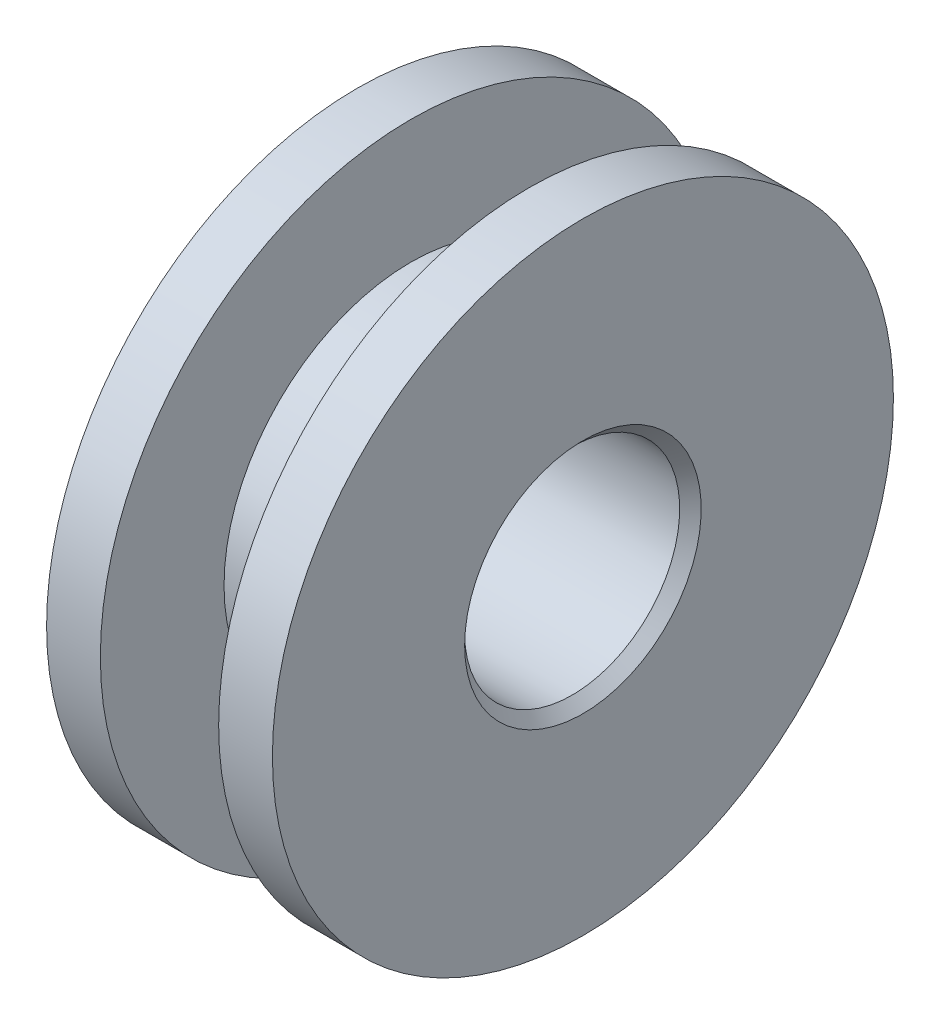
ISO-10303-21;
HEADER;
FILE_DESCRIPTION(('STEP AP214'),'2;1');
FILE_NAME('part.step','',(''),(''),'','','');
FILE_SCHEMA(('AUTOMOTIVE_DESIGN { 1 0 10303 214 1 1 1 1 }'));
ENDSEC;
DATA;
#1=APPLICATION_CONTEXT('core data for automotive mechanical design processes');
#2=APPLICATION_PROTOCOL_DEFINITION('international standard','automotive_design',2000,#1);
#3=PRODUCT_CONTEXT('',#1,'mechanical');
#4=PRODUCT('Part','Part','',(#3));
#5=PRODUCT_RELATED_PRODUCT_CATEGORY('part','',(#4));
#6=PRODUCT_DEFINITION_FORMATION('','',#4);
#7=PRODUCT_DEFINITION_CONTEXT('part definition',#1,'design');
#8=PRODUCT_DEFINITION('design','',#6,#7);
#9=PRODUCT_DEFINITION_SHAPE('','',#8);
#10=(LENGTH_UNIT() NAMED_UNIT(*) SI_UNIT(.MILLI.,.METRE.));
#11=(NAMED_UNIT(*) PLANE_ANGLE_UNIT() SI_UNIT($,.RADIAN.));
#12=(NAMED_UNIT(*) SI_UNIT($,.STERADIAN.) SOLID_ANGLE_UNIT());
#13=UNCERTAINTY_MEASURE_WITH_UNIT(LENGTH_MEASURE(1.E-05),#10,'distance_accuracy_value','');
#14=(GEOMETRIC_REPRESENTATION_CONTEXT(3) GLOBAL_UNCERTAINTY_ASSIGNED_CONTEXT((#13)) GLOBAL_UNIT_ASSIGNED_CONTEXT((#10,
#11,#12)) REPRESENTATION_CONTEXT('',''));
#15=CARTESIAN_POINT('',(0.,0.,0.));
#16=DIRECTION('',(0.,0.,1.));
#17=DIRECTION('',(1.,0.,0.));
#18=AXIS2_PLACEMENT_3D('',#15,#16,#17);
#19=CARTESIAN_POINT('',(0.,0.,0.));
#20=DIRECTION('',(-1.,0.,0.));
#21=DIRECTION('',(0.,0.,1.));
#22=AXIS2_PLACEMENT_3D('',#19,#20,#21);
#23=CYLINDRICAL_SURFACE('',#22,14.4360098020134);
#24=CARTESIAN_POINT('',(0.,0.,0.));
#25=DIRECTION('',(-1.,0.,0.));
#26=DIRECTION('',(0.,0.,1.));
#27=AXIS2_PLACEMENT_3D('',#24,#25,#26);
#28=CIRCLE('',#27,14.4360098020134);
#29=CARTESIAN_POINT('',(0.,0.,14.4360098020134));
#30=VERTEX_POINT('',#29);
#31=EDGE_CURVE('E49',#30,#30,#28,.T.);
#32=ORIENTED_EDGE('',*,*,#31,.F.);
#33=EDGE_LOOP('',(#32));
#34=FACE_BOUND('',#33,.T.);
#35=CARTESIAN_POINT('',(2.5,0.,0.));
#36=DIRECTION('',(-1.,0.,0.));
#37=DIRECTION('',(0.,0.,1.));
#38=AXIS2_PLACEMENT_3D('',#35,#36,#37);
#39=CIRCLE('',#38,14.4360098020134);
#40=CARTESIAN_POINT('',(2.5,0.,14.4360098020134));
#41=VERTEX_POINT('',#40);
#42=EDGE_CURVE('E64',#41,#41,#39,.T.);
#43=ORIENTED_EDGE('',*,*,#42,.T.);
#44=EDGE_LOOP('',(#43));
#45=FACE_BOUND('',#44,.T.);
#46=ADVANCED_FACE('F29',(#34,#45),#23,.T.);
#47=CARTESIAN_POINT('',(0.,5.,0.));
#48=DIRECTION('',(1.,0.,0.));
#49=DIRECTION('',(0.,0.,-1.));
#50=AXIS2_PLACEMENT_3D('',#47,#48,#49);
#51=PLANE('',#50);
#52=CARTESIAN_POINT('',(0.,0.,0.));
#53=DIRECTION('',(1.,0.,0.));
#54=DIRECTION('',(0.,0.,-1.));
#55=AXIS2_PLACEMENT_3D('',#52,#53,#54);
#56=CIRCLE('',#55,5.5);
#57=CARTESIAN_POINT('',(0.,0.,-5.5));
#58=VERTEX_POINT('',#57);
#59=EDGE_CURVE('E36',#58,#58,#56,.T.);
#60=ORIENTED_EDGE('',*,*,#59,.T.);
#61=EDGE_LOOP('',(#60));
#62=FACE_BOUND('',#61,.T.);
#63=ORIENTED_EDGE('',*,*,#31,.T.);
#64=EDGE_LOOP('',(#63));
#65=FACE_BOUND('',#64,.T.);
#66=ADVANCED_FACE('F101',(#62,#65),#51,.F.);
#67=CARTESIAN_POINT('',(0.,0.,0.));
#68=DIRECTION('',(-1.,0.,0.));
#69=DIRECTION('',(0.,0.,1.));
#70=AXIS2_PLACEMENT_3D('',#67,#68,#69);
#71=CYLINDRICAL_SURFACE('',#70,5.);
#72=CARTESIAN_POINT('',(0.5,0.,0.));
#73=DIRECTION('',(1.,0.,0.));
#74=DIRECTION('',(0.,0.,-1.));
#75=AXIS2_PLACEMENT_3D('',#72,#73,#74);
#76=CIRCLE('',#75,5.);
#77=CARTESIAN_POINT('',(0.5,0.,-5.));
#78=VERTEX_POINT('',#77);
#79=EDGE_CURVE('E40',#78,#78,#76,.F.);
#80=ORIENTED_EDGE('',*,*,#79,.T.);
#81=EDGE_LOOP('',(#80));
#82=FACE_BOUND('',#81,.T.);
#83=CARTESIAN_POINT('',(10.,0.,0.));
#84=DIRECTION('',(-1.,0.,0.));
#85=DIRECTION('',(0.,0.,1.));
#86=AXIS2_PLACEMENT_3D('',#83,#84,#85);
#87=CIRCLE('',#86,5.);
#88=CARTESIAN_POINT('',(10.,0.,5.));
#89=VERTEX_POINT('',#88);
#90=EDGE_CURVE('E44',#89,#89,#87,.F.);
#91=ORIENTED_EDGE('',*,*,#90,.T.);
#92=EDGE_LOOP('',(#91));
#93=FACE_BOUND('',#92,.T.);
#94=ADVANCED_FACE('F96',(#82,#93),#71,.F.);
#95=CARTESIAN_POINT('',(10.5,14.4360098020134,0.));
#96=DIRECTION('',(-1.,0.,0.));
#97=DIRECTION('',(0.,0.,1.));
#98=AXIS2_PLACEMENT_3D('',#95,#96,#97);
#99=PLANE('',#98);
#100=CARTESIAN_POINT('',(10.5,0.,0.));
#101=DIRECTION('',(-1.,0.,0.));
#102=DIRECTION('',(0.,0.,1.));
#103=AXIS2_PLACEMENT_3D('',#100,#101,#102);
#104=CIRCLE('',#103,5.5);
#105=CARTESIAN_POINT('',(10.5,0.,5.5));
#106=VERTEX_POINT('',#105);
#107=EDGE_CURVE('E10',#106,#106,#104,.T.);
#108=ORIENTED_EDGE('',*,*,#107,.T.);
#109=EDGE_LOOP('',(#108));
#110=FACE_BOUND('',#109,.T.);
#111=CARTESIAN_POINT('',(10.5,0.,0.));
#112=DIRECTION('',(-1.,0.,0.));
#113=DIRECTION('',(0.,0.,1.));
#114=AXIS2_PLACEMENT_3D('',#111,#112,#113);
#115=CIRCLE('',#114,14.4360098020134);
#116=CARTESIAN_POINT('',(10.5,0.,14.4360098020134));
#117=VERTEX_POINT('',#116);
#118=EDGE_CURVE('E52',#117,#117,#115,.T.);
#119=ORIENTED_EDGE('',*,*,#118,.F.);
#120=EDGE_LOOP('',(#119));
#121=FACE_BOUND('',#120,.T.);
#122=ADVANCED_FACE('F91',(#110,#121),#99,.F.);
#123=CARTESIAN_POINT('',(0.,0.,0.));
#124=DIRECTION('',(-1.,0.,0.));
#125=DIRECTION('',(0.,0.,1.));
#126=AXIS2_PLACEMENT_3D('',#123,#124,#125);
#127=CYLINDRICAL_SURFACE('',#126,14.4360098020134);
#128=CARTESIAN_POINT('',(8.,0.,0.));
#129=DIRECTION('',(-1.,0.,0.));
#130=DIRECTION('',(0.,0.,1.));
#131=AXIS2_PLACEMENT_3D('',#128,#129,#130);
#132=CIRCLE('',#131,14.4360098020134);
#133=CARTESIAN_POINT('',(8.,0.,14.4360098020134));
#134=VERTEX_POINT('',#133);
#135=EDGE_CURVE('E55',#134,#134,#132,.T.);
#136=ORIENTED_EDGE('',*,*,#135,.F.);
#137=EDGE_LOOP('',(#136));
#138=FACE_BOUND('',#137,.T.);
#139=ORIENTED_EDGE('',*,*,#118,.T.);
#140=EDGE_LOOP('',(#139));
#141=FACE_BOUND('',#140,.T.);
#142=ADVANCED_FACE('F85',(#138,#141),#127,.T.);
#143=CARTESIAN_POINT('',(8.,8.68600980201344,0.));
#144=DIRECTION('',(1.,0.,0.));
#145=DIRECTION('',(0.,0.,-1.));
#146=AXIS2_PLACEMENT_3D('',#143,#144,#145);
#147=PLANE('',#146);
#148=CARTESIAN_POINT('',(8.,0.,0.));
#149=DIRECTION('',(-1.,0.,0.));
#150=DIRECTION('',(0.,0.,1.));
#151=AXIS2_PLACEMENT_3D('',#148,#149,#150);
#152=CIRCLE('',#151,8.68600980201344);
#153=CARTESIAN_POINT('',(8.,0.,8.68600980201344));
#154=VERTEX_POINT('',#153);
#155=EDGE_CURVE('E58',#154,#154,#152,.T.);
#156=ORIENTED_EDGE('',*,*,#155,.F.);
#157=EDGE_LOOP('',(#156));
#158=FACE_BOUND('',#157,.T.);
#159=ORIENTED_EDGE('',*,*,#135,.T.);
#160=EDGE_LOOP('',(#159));
#161=FACE_BOUND('',#160,.T.);
#162=ADVANCED_FACE('F79',(#158,#161),#147,.F.);
#163=CARTESIAN_POINT('',(0.,0.,0.));
#164=DIRECTION('',(-1.,0.,0.));
#165=DIRECTION('',(0.,0.,1.));
#166=AXIS2_PLACEMENT_3D('',#163,#164,#165);
#167=CYLINDRICAL_SURFACE('',#166,8.68600980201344);
#168=CARTESIAN_POINT('',(2.5,0.,0.));
#169=DIRECTION('',(-1.,0.,0.));
#170=DIRECTION('',(0.,0.,1.));
#171=AXIS2_PLACEMENT_3D('',#168,#169,#170);
#172=CIRCLE('',#171,8.68600980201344);
#173=CARTESIAN_POINT('',(2.5,0.,8.68600980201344));
#174=VERTEX_POINT('',#173);
#175=EDGE_CURVE('E61',#174,#174,#172,.T.);
#176=ORIENTED_EDGE('',*,*,#175,.F.);
#177=EDGE_LOOP('',(#176));
#178=FACE_BOUND('',#177,.T.);
#179=ORIENTED_EDGE('',*,*,#155,.T.);
#180=EDGE_LOOP('',(#179));
#181=FACE_BOUND('',#180,.T.);
#182=ADVANCED_FACE('F73',(#178,#181),#167,.T.);
#183=CARTESIAN_POINT('',(2.5,14.4360098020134,0.));
#184=DIRECTION('',(-1.,0.,0.));
#185=DIRECTION('',(0.,0.,1.));
#186=AXIS2_PLACEMENT_3D('',#183,#184,#185);
#187=PLANE('',#186);
#188=ORIENTED_EDGE('',*,*,#42,.F.);
#189=EDGE_LOOP('',(#188));
#190=FACE_BOUND('',#189,.T.);
#191=ORIENTED_EDGE('',*,*,#175,.T.);
#192=EDGE_LOOP('',(#191));
#193=FACE_BOUND('',#192,.T.);
#194=ADVANCED_FACE('F69',(#190,#193),#187,.F.);
#195=CARTESIAN_POINT('',(0.5,0.,0.));
#196=DIRECTION('',(-1.,0.,0.));
#197=DIRECTION('',(0.,0.,1.));
#198=AXIS2_PLACEMENT_3D('',#195,#196,#197);
#199=CONICAL_SURFACE('',#198,5.,0.78539816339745);
#200=ORIENTED_EDGE('',*,*,#59,.F.);
#201=EDGE_LOOP('',(#200));
#202=FACE_BOUND('',#201,.T.);
#203=ORIENTED_EDGE('',*,*,#79,.F.);
#204=EDGE_LOOP('',(#203));
#205=FACE_BOUND('',#204,.T.);
#206=ADVANCED_FACE('F72',(#202,#205),#199,.F.);
#207=CARTESIAN_POINT('',(10.5,0.,0.));
#208=DIRECTION('',(1.,0.,0.));
#209=DIRECTION('',(0.,0.,-1.));
#210=AXIS2_PLACEMENT_3D('',#207,#208,#209);
#211=CONICAL_SURFACE('',#210,5.5,0.785398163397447);
#212=ORIENTED_EDGE('',*,*,#90,.F.);
#213=EDGE_LOOP('',(#212));
#214=FACE_BOUND('',#213,.T.);
#215=ORIENTED_EDGE('',*,*,#107,.F.);
#216=EDGE_LOOP('',(#215));
#217=FACE_BOUND('',#216,.T.);
#218=ADVANCED_FACE('F31',(#214,#217),#211,.F.);
#219=CLOSED_SHELL('',(#46,#66,#94,#122,#142,#162,#182,#194,#206,#218));
#220=MANIFOLD_SOLID_BREP('B2',#219);
#221=ADVANCED_BREP_SHAPE_REPRESENTATION('',(#18,#220),#14);
#222=SHAPE_DEFINITION_REPRESENTATION(#9,#221);
ENDSEC;
END-ISO-10303-21;
